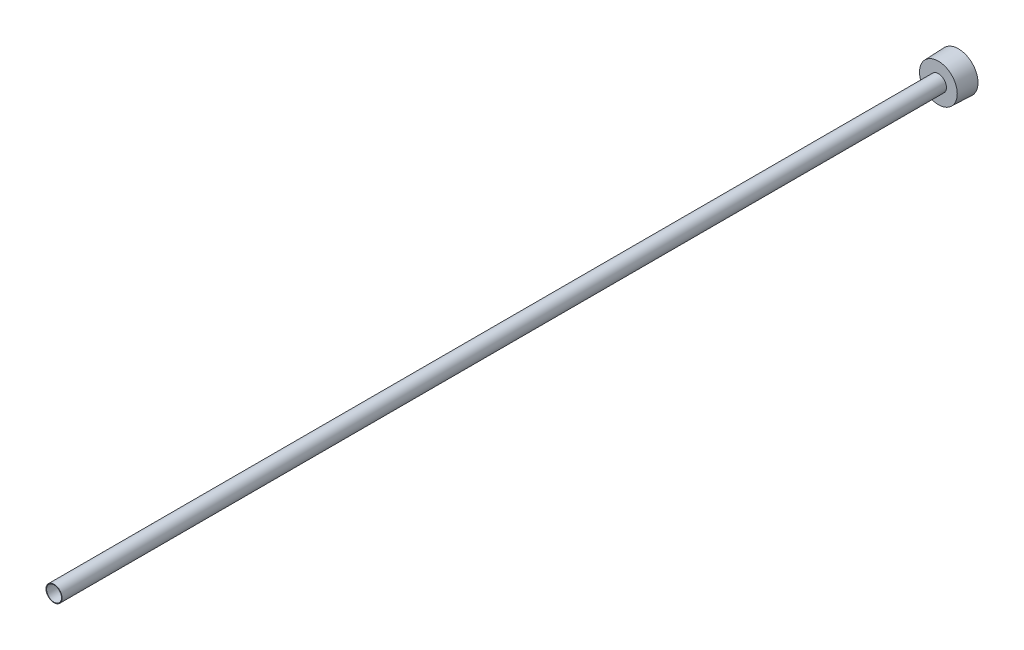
ISO-10303-21;
HEADER;
FILE_DESCRIPTION(('STEP AP214'),'2;1');
FILE_NAME('part.step','',(''),(''),'','','');
FILE_SCHEMA(('AUTOMOTIVE_DESIGN { 1 0 10303 214 1 1 1 1 }'));
ENDSEC;
DATA;
#1=APPLICATION_CONTEXT('core data for automotive mechanical design processes');
#2=APPLICATION_PROTOCOL_DEFINITION('international standard','automotive_design',2000,#1);
#3=PRODUCT_CONTEXT('',#1,'mechanical');
#4=PRODUCT('Part','Part','',(#3));
#5=PRODUCT_RELATED_PRODUCT_CATEGORY('part','',(#4));
#6=PRODUCT_DEFINITION_FORMATION('','',#4);
#7=PRODUCT_DEFINITION_CONTEXT('part definition',#1,'design');
#8=PRODUCT_DEFINITION('design','',#6,#7);
#9=PRODUCT_DEFINITION_SHAPE('','',#8);
#10=(LENGTH_UNIT() NAMED_UNIT(*) SI_UNIT(.MILLI.,.METRE.));
#11=(NAMED_UNIT(*) PLANE_ANGLE_UNIT() SI_UNIT($,.RADIAN.));
#12=(NAMED_UNIT(*) SI_UNIT($,.STERADIAN.) SOLID_ANGLE_UNIT());
#13=UNCERTAINTY_MEASURE_WITH_UNIT(LENGTH_MEASURE(1.E-05),#10,'distance_accuracy_value','');
#14=(GEOMETRIC_REPRESENTATION_CONTEXT(3) GLOBAL_UNCERTAINTY_ASSIGNED_CONTEXT((#13)) GLOBAL_UNIT_ASSIGNED_CONTEXT((#10,
#11,#12)) REPRESENTATION_CONTEXT('',''));
#15=CARTESIAN_POINT('',(0.,0.,0.));
#16=DIRECTION('',(0.,0.,1.));
#17=DIRECTION('',(1.,0.,0.));
#18=AXIS2_PLACEMENT_3D('',#15,#16,#17);
#19=CARTESIAN_POINT('',(0.,0.,0.));
#20=DIRECTION('',(0.,0.,1.));
#21=DIRECTION('',(1.,0.,0.));
#22=AXIS2_PLACEMENT_3D('',#19,#20,#21);
#23=CYLINDRICAL_SURFACE('',#22,5.0419);
#24=CARTESIAN_POINT('',(0.,0.,609.6));
#25=DIRECTION('',(0.,0.,1.));
#26=DIRECTION('',(1.,0.,0.));
#27=AXIS2_PLACEMENT_3D('',#24,#25,#26);
#28=CIRCLE('',#27,5.0419);
#29=CARTESIAN_POINT('',(5.0419,0.,609.6));
#30=VERTEX_POINT('',#29);
#31=EDGE_CURVE('E141',#30,#30,#28,.T.);
#32=ORIENTED_EDGE('',*,*,#31,.T.);
#33=EDGE_LOOP('',(#32));
#34=FACE_BOUND('',#33,.T.);
#35=CARTESIAN_POINT('',(0.,0.,9.525));
#36=DIRECTION('',(0.,0.,-1.));
#37=DIRECTION('',(-1.,0.,0.));
#38=AXIS2_PLACEMENT_3D('',#35,#36,#37);
#39=CIRCLE('',#38,5.0419);
#40=CARTESIAN_POINT('',(-5.0419,0.,9.525));
#41=VERTEX_POINT('',#40);
#42=EDGE_CURVE('E36',#41,#41,#39,.F.);
#43=ORIENTED_EDGE('',*,*,#42,.F.);
#44=EDGE_LOOP('',(#43));
#45=FACE_BOUND('',#44,.T.);
#46=ADVANCED_FACE('F32',(#34,#45),#23,.F.);
#47=CARTESIAN_POINT('',(0.,5.42289999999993,609.6));
#48=DIRECTION('',(0.,0.,-1.));
#49=DIRECTION('',(-1.,0.,0.));
#50=AXIS2_PLACEMENT_3D('',#47,#48,#49);
#51=PLANE('',#50);
#52=ORIENTED_EDGE('',*,*,#31,.F.);
#53=EDGE_LOOP('',(#52));
#54=FACE_BOUND('',#53,.T.);
#55=CARTESIAN_POINT('',(0.,0.,609.6));
#56=DIRECTION('',(0.,0.,1.));
#57=DIRECTION('',(1.,0.,0.));
#58=AXIS2_PLACEMENT_3D('',#55,#56,#57);
#59=CIRCLE('',#58,5.42289999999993);
#60=CARTESIAN_POINT('',(5.42289999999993,0.,609.6));
#61=VERTEX_POINT('',#60);
#62=EDGE_CURVE('E144',#61,#61,#59,.T.);
#63=ORIENTED_EDGE('',*,*,#62,.T.);
#64=EDGE_LOOP('',(#63));
#65=FACE_BOUND('',#64,.T.);
#66=ADVANCED_FACE('F34',(#54,#65),#51,.F.);
#67=CARTESIAN_POINT('',(0.,0.,0.));
#68=DIRECTION('',(0.,0.,1.));
#69=DIRECTION('',(1.,0.,0.));
#70=AXIS2_PLACEMENT_3D('',#67,#68,#69);
#71=PLANE('',#70);
#72=DIRECTION('',(-0.866025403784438,0.5,0.));
#73=VECTOR('',#72,1.);
#74=CARTESIAN_POINT('',(0.,-10.9985226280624,0.));
#75=LINE('',#74,#73);
#76=CARTESIAN_POINT('',(0.,-10.9985226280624,0.));
#77=VERTEX_POINT('',#76);
#78=CARTESIAN_POINT('',(-9.525,-5.49926131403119,0.));
#79=VERTEX_POINT('',#78);
#80=EDGE_CURVE('E123',#77,#79,#75,.T.);
#81=ORIENTED_EDGE('',*,*,#80,.F.);
#82=DIRECTION('',(-0.866025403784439,-0.5,0.));
#83=VECTOR('',#82,1.);
#84=CARTESIAN_POINT('',(9.525,-5.49926131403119,0.));
#85=LINE('',#84,#83);
#86=CARTESIAN_POINT('',(9.525,-5.49926131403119,0.));
#87=VERTEX_POINT('',#86);
#88=EDGE_CURVE('E48',#87,#77,#85,.T.);
#89=ORIENTED_EDGE('',*,*,#88,.F.);
#90=DIRECTION('',(0.,-1.,0.));
#91=VECTOR('',#90,1.);
#92=CARTESIAN_POINT('',(9.525,5.49926131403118,0.));
#93=LINE('',#92,#91);
#94=CARTESIAN_POINT('',(9.525,5.49926131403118,0.));
#95=VERTEX_POINT('',#94);
#96=EDGE_CURVE('E132',#95,#87,#93,.T.);
#97=ORIENTED_EDGE('',*,*,#96,.F.);
#98=DIRECTION('',(0.866025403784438,-0.5,0.));
#99=VECTOR('',#98,1.);
#100=CARTESIAN_POINT('',(0.,10.9985226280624,0.));
#101=LINE('',#100,#99);
#102=CARTESIAN_POINT('',(0.,10.9985226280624,0.));
#103=VERTEX_POINT('',#102);
#104=EDGE_CURVE('E130',#103,#95,#101,.T.);
#105=ORIENTED_EDGE('',*,*,#104,.F.);
#106=DIRECTION('',(0.866025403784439,0.5,0.));
#107=VECTOR('',#106,1.);
#108=CARTESIAN_POINT('',(-9.525,5.49926131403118,0.));
#109=LINE('',#108,#107);
#110=CARTESIAN_POINT('',(-9.525,5.49926131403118,0.));
#111=VERTEX_POINT('',#110);
#112=EDGE_CURVE('E96',#111,#103,#109,.T.);
#113=ORIENTED_EDGE('',*,*,#112,.F.);
#114=DIRECTION('',(0.,1.,0.));
#115=VECTOR('',#114,1.);
#116=CARTESIAN_POINT('',(-9.525,-5.49926131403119,0.));
#117=LINE('',#116,#115);
#118=EDGE_CURVE('E126',#79,#111,#117,.T.);
#119=ORIENTED_EDGE('',*,*,#118,.F.);
#120=EDGE_LOOP('',(#81,#89,#97,#105,#113,#119));
#121=FACE_BOUND('',#120,.T.);
#122=CARTESIAN_POINT('',(0.,0.,0.));
#123=DIRECTION('',(0.,0.,1.));
#124=DIRECTION('',(1.,0.,0.));
#125=AXIS2_PLACEMENT_3D('',#122,#123,#124);
#126=CIRCLE('',#125,13.2207);
#127=CARTESIAN_POINT('',(13.2207,0.,0.));
#128=VERTEX_POINT('',#127);
#129=EDGE_CURVE('E11',#128,#128,#126,.T.);
#130=ORIENTED_EDGE('',*,*,#129,.F.);
#131=EDGE_LOOP('',(#130));
#132=FACE_BOUND('',#131,.T.);
#133=ADVANCED_FACE('F158',(#121,#132),#71,.F.);
#134=CARTESIAN_POINT('',(0.,0.,0.));
#135=DIRECTION('',(0.,0.,-1.));
#136=DIRECTION('',(-1.,0.,0.));
#137=AXIS2_PLACEMENT_3D('',#134,#135,#136);
#138=CONICAL_SURFACE('',#137,13.2207,0.0364599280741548);
#139=CARTESIAN_POINT('',(0.,0.,13.4874));
#140=DIRECTION('',(0.,0.,1.));
#141=DIRECTION('',(1.,0.,0.));
#142=AXIS2_PLACEMENT_3D('',#139,#140,#141);
#143=CIRCLE('',#142,12.7287323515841);
#144=CARTESIAN_POINT('',(12.7287323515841,0.,13.4874));
#145=VERTEX_POINT('',#144);
#146=EDGE_CURVE('E41',#145,#145,#143,.T.);
#147=ORIENTED_EDGE('',*,*,#146,.F.);
#148=EDGE_LOOP('',(#147));
#149=FACE_BOUND('',#148,.T.);
#150=ORIENTED_EDGE('',*,*,#129,.T.);
#151=EDGE_LOOP('',(#150));
#152=FACE_BOUND('',#151,.T.);
#153=ADVANCED_FACE('F155',(#149,#152),#138,.T.);
#154=CARTESIAN_POINT('',(0.,12.7287323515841,13.4874));
#155=DIRECTION('',(0.,0.,-1.));
#156=DIRECTION('',(-1.,0.,0.));
#157=AXIS2_PLACEMENT_3D('',#154,#155,#156);
#158=PLANE('',#157);
#159=CARTESIAN_POINT('',(0.,0.,13.4874));
#160=DIRECTION('',(0.,0.,1.));
#161=DIRECTION('',(1.,0.,0.));
#162=AXIS2_PLACEMENT_3D('',#159,#160,#161);
#163=CIRCLE('',#162,5.4229);
#164=CARTESIAN_POINT('',(5.4229,0.,13.4874));
#165=VERTEX_POINT('',#164);
#166=EDGE_CURVE('E147',#165,#165,#163,.T.);
#167=ORIENTED_EDGE('',*,*,#166,.F.);
#168=EDGE_LOOP('',(#167));
#169=FACE_BOUND('',#168,.T.);
#170=ORIENTED_EDGE('',*,*,#146,.T.);
#171=EDGE_LOOP('',(#170));
#172=FACE_BOUND('',#171,.T.);
#173=ADVANCED_FACE('F153',(#169,#172),#158,.F.);
#174=CARTESIAN_POINT('',(0.,0.,278.00111462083));
#175=DIRECTION('',(0.,0.,1.));
#176=DIRECTION('',(1.,0.,0.));
#177=AXIS2_PLACEMENT_3D('',#174,#175,#176);
#178=CYLINDRICAL_SURFACE('',#177,5.42289999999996);
#179=ORIENTED_EDGE('',*,*,#62,.F.);
#180=EDGE_LOOP('',(#179));
#181=FACE_BOUND('',#180,.T.);
#182=ORIENTED_EDGE('',*,*,#166,.T.);
#183=EDGE_LOOP('',(#182));
#184=FACE_BOUND('',#183,.T.);
#185=ADVANCED_FACE('F179',(#181,#184),#178,.T.);
#186=CARTESIAN_POINT('',(0.,-10.9985226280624,9.525));
#187=DIRECTION('',(0.,0.,-1.));
#188=DIRECTION('',(-1.,0.,0.));
#189=AXIS2_PLACEMENT_3D('',#186,#187,#188);
#190=PLANE('',#189);
#191=DIRECTION('',(-0.866025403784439,-0.5,0.));
#192=VECTOR('',#191,1.);
#193=CARTESIAN_POINT('',(9.525,-5.49926131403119,9.525));
#194=LINE('',#193,#192);
#195=CARTESIAN_POINT('',(9.525,-5.49926131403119,9.525));
#196=VERTEX_POINT('',#195);
#197=CARTESIAN_POINT('',(0.,-10.9985226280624,9.525));
#198=VERTEX_POINT('',#197);
#199=EDGE_CURVE('E134',#196,#198,#194,.T.);
#200=ORIENTED_EDGE('',*,*,#199,.T.);
#201=DIRECTION('',(-0.866025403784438,0.5,0.));
#202=VECTOR('',#201,1.);
#203=CARTESIAN_POINT('',(0.,-10.9985226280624,9.525));
#204=LINE('',#203,#202);
#205=CARTESIAN_POINT('',(-9.525,-5.49926131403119,9.525));
#206=VERTEX_POINT('',#205);
#207=EDGE_CURVE('E117',#198,#206,#204,.T.);
#208=ORIENTED_EDGE('',*,*,#207,.T.);
#209=DIRECTION('',(0.,1.,0.));
#210=VECTOR('',#209,1.);
#211=CARTESIAN_POINT('',(-9.525,-5.49926131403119,9.525));
#212=LINE('',#211,#210);
#213=CARTESIAN_POINT('',(-9.525,5.49926131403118,9.525));
#214=VERTEX_POINT('',#213);
#215=EDGE_CURVE('E115',#206,#214,#212,.T.);
#216=ORIENTED_EDGE('',*,*,#215,.T.);
#217=DIRECTION('',(0.866025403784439,0.5,0.));
#218=VECTOR('',#217,1.);
#219=CARTESIAN_POINT('',(-9.525,5.49926131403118,9.525));
#220=LINE('',#219,#218);
#221=CARTESIAN_POINT('',(0.,10.9985226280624,9.525));
#222=VERTEX_POINT('',#221);
#223=EDGE_CURVE('E93',#214,#222,#220,.T.);
#224=ORIENTED_EDGE('',*,*,#223,.T.);
#225=DIRECTION('',(0.866025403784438,-0.5,0.));
#226=VECTOR('',#225,1.);
#227=CARTESIAN_POINT('',(0.,10.9985226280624,9.525));
#228=LINE('',#227,#226);
#229=CARTESIAN_POINT('',(9.525,5.49926131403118,9.525));
#230=VERTEX_POINT('',#229);
#231=EDGE_CURVE('E104',#222,#230,#228,.T.);
#232=ORIENTED_EDGE('',*,*,#231,.T.);
#233=DIRECTION('',(0.,-1.,0.));
#234=VECTOR('',#233,1.);
#235=CARTESIAN_POINT('',(9.525,5.49926131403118,9.525));
#236=LINE('',#235,#234);
#237=EDGE_CURVE('E108',#230,#196,#236,.T.);
#238=ORIENTED_EDGE('',*,*,#237,.T.);
#239=EDGE_LOOP('',(#200,#208,#216,#224,#232,#238));
#240=FACE_BOUND('',#239,.T.);
#241=ORIENTED_EDGE('',*,*,#42,.T.);
#242=EDGE_LOOP('',(#241));
#243=FACE_BOUND('',#242,.T.);
#244=ADVANCED_FACE('F111',(#240,#243),#190,.T.);
#245=CARTESIAN_POINT('',(9.525,-5.49926131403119,9.525));
#246=DIRECTION('',(0.5,-0.866025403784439,0.));
#247=DIRECTION('',(0.866025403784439,0.5,0.));
#248=AXIS2_PLACEMENT_3D('',#245,#246,#247);
#249=PLANE('',#248);
#250=ORIENTED_EDGE('',*,*,#88,.T.);
#251=DIRECTION('',(0.,0.,-1.));
#252=VECTOR('',#251,1.);
#253=CARTESIAN_POINT('',(0.,-10.9985226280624,9.525));
#254=LINE('',#253,#252);
#255=EDGE_CURVE('E78',#198,#77,#254,.T.);
#256=ORIENTED_EDGE('',*,*,#255,.F.);
#257=ORIENTED_EDGE('',*,*,#199,.F.);
#258=DIRECTION('',(0.,0.,-1.));
#259=VECTOR('',#258,1.);
#260=CARTESIAN_POINT('',(9.525,-5.49926131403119,9.525));
#261=LINE('',#260,#259);
#262=EDGE_CURVE('E56',#196,#87,#261,.T.);
#263=ORIENTED_EDGE('',*,*,#262,.T.);
#264=EDGE_LOOP('',(#250,#256,#257,#263));
#265=FACE_BOUND('',#264,.T.);
#266=ADVANCED_FACE('F177',(#265),#249,.F.);
#267=CARTESIAN_POINT('',(9.525,5.49926131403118,9.525));
#268=DIRECTION('',(1.,0.,0.));
#269=DIRECTION('',(0.,0.,-1.));
#270=AXIS2_PLACEMENT_3D('',#267,#268,#269);
#271=PLANE('',#270);
#272=ORIENTED_EDGE('',*,*,#96,.T.);
#273=ORIENTED_EDGE('',*,*,#262,.F.);
#274=ORIENTED_EDGE('',*,*,#237,.F.);
#275=DIRECTION('',(0.,0.,-1.));
#276=VECTOR('',#275,1.);
#277=CARTESIAN_POINT('',(9.525,5.49926131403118,9.525));
#278=LINE('',#277,#276);
#279=EDGE_CURVE('E100',#230,#95,#278,.T.);
#280=ORIENTED_EDGE('',*,*,#279,.T.);
#281=EDGE_LOOP('',(#272,#273,#274,#280));
#282=FACE_BOUND('',#281,.T.);
#283=ADVANCED_FACE('F208',(#282),#271,.F.);
#284=CARTESIAN_POINT('',(0.,10.9985226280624,9.525));
#285=DIRECTION('',(0.5,0.866025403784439,0.));
#286=DIRECTION('',(-0.866025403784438,0.5,0.));
#287=AXIS2_PLACEMENT_3D('',#284,#285,#286);
#288=PLANE('',#287);
#289=ORIENTED_EDGE('',*,*,#104,.T.);
#290=ORIENTED_EDGE('',*,*,#279,.F.);
#291=ORIENTED_EDGE('',*,*,#231,.F.);
#292=DIRECTION('',(0.,0.,-1.));
#293=VECTOR('',#292,1.);
#294=CARTESIAN_POINT('',(0.,10.9985226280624,9.525));
#295=LINE('',#294,#293);
#296=EDGE_CURVE('E89',#222,#103,#295,.T.);
#297=ORIENTED_EDGE('',*,*,#296,.T.);
#298=EDGE_LOOP('',(#289,#290,#291,#297));
#299=FACE_BOUND('',#298,.T.);
#300=ADVANCED_FACE('F105',(#299),#288,.F.);
#301=CARTESIAN_POINT('',(-9.525,5.49926131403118,9.525));
#302=DIRECTION('',(-0.5,0.866025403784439,0.));
#303=DIRECTION('',(-0.866025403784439,-0.5,0.));
#304=AXIS2_PLACEMENT_3D('',#301,#302,#303);
#305=PLANE('',#304);
#306=ORIENTED_EDGE('',*,*,#112,.T.);
#307=ORIENTED_EDGE('',*,*,#296,.F.);
#308=ORIENTED_EDGE('',*,*,#223,.F.);
#309=DIRECTION('',(0.,0.,-1.));
#310=VECTOR('',#309,1.);
#311=CARTESIAN_POINT('',(-9.525,5.49926131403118,9.525));
#312=LINE('',#311,#310);
#313=EDGE_CURVE('E101',#214,#111,#312,.T.);
#314=ORIENTED_EDGE('',*,*,#313,.T.);
#315=EDGE_LOOP('',(#306,#307,#308,#314));
#316=FACE_BOUND('',#315,.T.);
#317=ADVANCED_FACE('F91',(#316),#305,.F.);
#318=CARTESIAN_POINT('',(-9.525,-5.49926131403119,9.525));
#319=DIRECTION('',(-1.,0.,0.));
#320=DIRECTION('',(0.,0.,1.));
#321=AXIS2_PLACEMENT_3D('',#318,#319,#320);
#322=PLANE('',#321);
#323=ORIENTED_EDGE('',*,*,#118,.T.);
#324=ORIENTED_EDGE('',*,*,#313,.F.);
#325=ORIENTED_EDGE('',*,*,#215,.F.);
#326=DIRECTION('',(0.,0.,-1.));
#327=VECTOR('',#326,1.);
#328=CARTESIAN_POINT('',(-9.525,-5.49926131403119,9.525));
#329=LINE('',#328,#327);
#330=EDGE_CURVE('E138',#206,#79,#329,.T.);
#331=ORIENTED_EDGE('',*,*,#330,.T.);
#332=EDGE_LOOP('',(#323,#324,#325,#331));
#333=FACE_BOUND('',#332,.T.);
#334=ADVANCED_FACE('F226',(#333),#322,.F.);
#335=CARTESIAN_POINT('',(0.,-10.9985226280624,9.525));
#336=DIRECTION('',(-0.5,-0.866025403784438,0.));
#337=DIRECTION('',(0.866025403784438,-0.5,0.));
#338=AXIS2_PLACEMENT_3D('',#335,#336,#337);
#339=PLANE('',#338);
#340=ORIENTED_EDGE('',*,*,#80,.T.);
#341=ORIENTED_EDGE('',*,*,#330,.F.);
#342=ORIENTED_EDGE('',*,*,#207,.F.);
#343=ORIENTED_EDGE('',*,*,#255,.T.);
#344=EDGE_LOOP('',(#340,#341,#342,#343));
#345=FACE_BOUND('',#344,.T.);
#346=ADVANCED_FACE('F233',(#345),#339,.F.);
#347=CLOSED_SHELL('',(#46,#66,#133,#153,#173,#185,#244,#266,#283,#300,#317,#334,#346));
#348=MANIFOLD_SOLID_BREP('B2',#347);
#349=ADVANCED_BREP_SHAPE_REPRESENTATION('',(#18,#348),#14);
#350=SHAPE_DEFINITION_REPRESENTATION(#9,#349);
ENDSEC;
END-ISO-10303-21;
